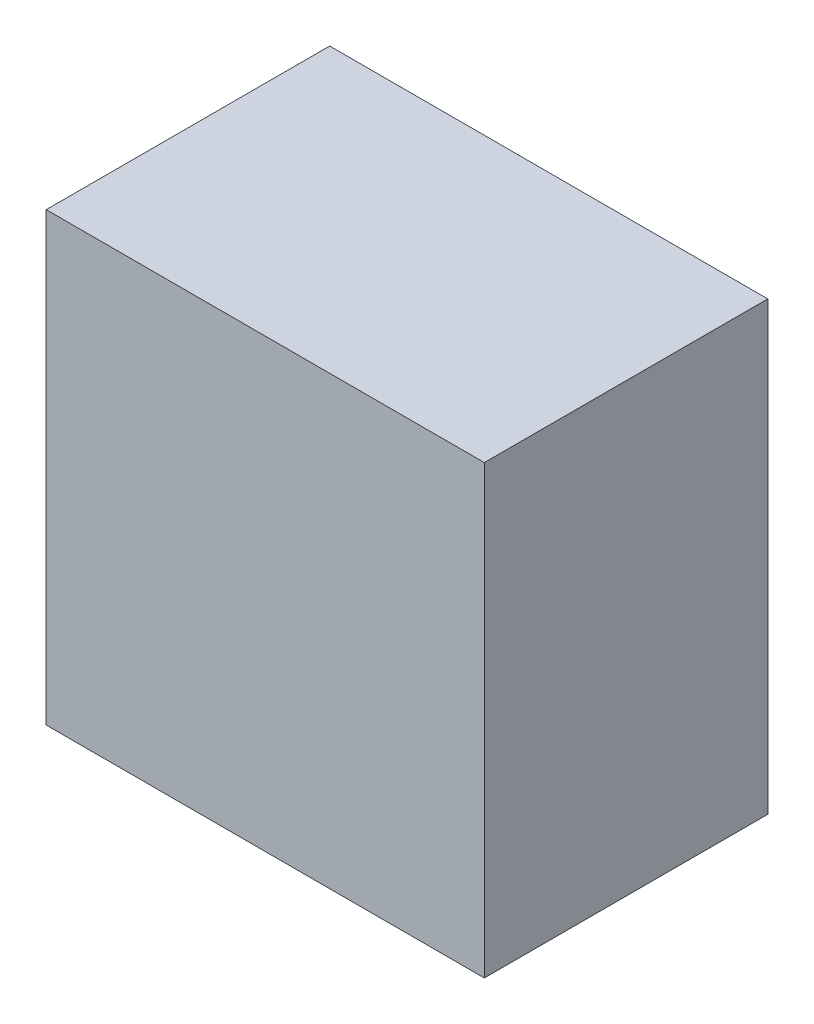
ISO-10303-21;
HEADER;
FILE_DESCRIPTION(('STEP AP214'),'2;1');
FILE_NAME('part.step','',(''),(''),'','','');
FILE_SCHEMA(('AUTOMOTIVE_DESIGN { 1 0 10303 214 1 1 1 1 }'));
ENDSEC;
DATA;
#1=APPLICATION_CONTEXT('core data for automotive mechanical design processes');
#2=APPLICATION_PROTOCOL_DEFINITION('international standard','automotive_design',2000,#1);
#3=PRODUCT_CONTEXT('',#1,'mechanical');
#4=PRODUCT('Part','Part','',(#3));
#5=PRODUCT_RELATED_PRODUCT_CATEGORY('part','',(#4));
#6=PRODUCT_DEFINITION_FORMATION('','',#4);
#7=PRODUCT_DEFINITION_CONTEXT('part definition',#1,'design');
#8=PRODUCT_DEFINITION('design','',#6,#7);
#9=PRODUCT_DEFINITION_SHAPE('','',#8);
#10=(LENGTH_UNIT() NAMED_UNIT(*) SI_UNIT(.MILLI.,.METRE.));
#11=(NAMED_UNIT(*) PLANE_ANGLE_UNIT() SI_UNIT($,.RADIAN.));
#12=(NAMED_UNIT(*) SI_UNIT($,.STERADIAN.) SOLID_ANGLE_UNIT());
#13=UNCERTAINTY_MEASURE_WITH_UNIT(LENGTH_MEASURE(1.E-05),#10,'distance_accuracy_value','');
#14=(GEOMETRIC_REPRESENTATION_CONTEXT(3) GLOBAL_UNCERTAINTY_ASSIGNED_CONTEXT((#13)) GLOBAL_UNIT_ASSIGNED_CONTEXT((#10,
#11,#12)) REPRESENTATION_CONTEXT('',''));
#15=CARTESIAN_POINT('',(0.,0.,0.));
#16=DIRECTION('',(0.,0.,1.));
#17=DIRECTION('',(1.,0.,0.));
#18=AXIS2_PLACEMENT_3D('',#15,#16,#17);
#19=CARTESIAN_POINT('',(0.,0.,50.8));
#20=DIRECTION('',(1.,0.,0.));
#21=DIRECTION('',(0.,0.,-1.));
#22=AXIS2_PLACEMENT_3D('',#19,#20,#21);
#23=PLANE('',#22);
#24=DIRECTION('',(0.,-1.,0.));
#25=VECTOR('',#24,1.);
#26=CARTESIAN_POINT('',(0.,0.,0.));
#27=LINE('',#26,#25);
#28=CARTESIAN_POINT('',(0.,79.9960055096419,0.));
#29=VERTEX_POINT('',#28);
#30=CARTESIAN_POINT('',(0.,0.,0.));
#31=VERTEX_POINT('',#30);
#32=EDGE_CURVE('E93',#29,#31,#27,.T.);
#33=ORIENTED_EDGE('',*,*,#32,.T.);
#34=DIRECTION('',(0.,0.,-1.));
#35=VECTOR('',#34,1.);
#36=CARTESIAN_POINT('',(0.,0.,50.8));
#37=LINE('',#36,#35);
#38=CARTESIAN_POINT('',(0.,0.,50.8));
#39=VERTEX_POINT('',#38);
#40=EDGE_CURVE('E11',#39,#31,#37,.T.);
#41=ORIENTED_EDGE('',*,*,#40,.F.);
#42=DIRECTION('',(0.,-1.,0.));
#43=VECTOR('',#42,1.);
#44=CARTESIAN_POINT('',(0.,0.,50.8));
#45=LINE('',#44,#43);
#46=CARTESIAN_POINT('',(0.,79.9960055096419,50.8));
#47=VERTEX_POINT('',#46);
#48=EDGE_CURVE('E81',#47,#39,#45,.T.);
#49=ORIENTED_EDGE('',*,*,#48,.F.);
#50=DIRECTION('',(0.,0.,-1.));
#51=VECTOR('',#50,1.);
#52=CARTESIAN_POINT('',(0.,79.9960055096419,50.8));
#53=LINE('',#52,#51);
#54=EDGE_CURVE('E89',#47,#29,#53,.T.);
#55=ORIENTED_EDGE('',*,*,#54,.T.);
#56=EDGE_LOOP('',(#33,#41,#49,#55));
#57=FACE_BOUND('',#56,.T.);
#58=ADVANCED_FACE('F30',(#57),#23,.F.);
#59=CARTESIAN_POINT('',(0.,0.,50.8));
#60=DIRECTION('',(0.,1.,0.));
#61=DIRECTION('',(0.,0.,1.));
#62=AXIS2_PLACEMENT_3D('',#59,#60,#61);
#63=PLANE('',#62);
#64=DIRECTION('',(1.,0.,0.));
#65=VECTOR('',#64,1.);
#66=CARTESIAN_POINT('',(0.,0.,0.));
#67=LINE('',#66,#65);
#68=CARTESIAN_POINT('',(78.5090909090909,0.,0.));
#69=VERTEX_POINT('',#68);
#70=EDGE_CURVE('E85',#31,#69,#67,.T.);
#71=ORIENTED_EDGE('',*,*,#70,.T.);
#72=DIRECTION('',(0.,0.,-1.));
#73=VECTOR('',#72,1.);
#74=CARTESIAN_POINT('',(78.5090909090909,0.,50.8));
#75=LINE('',#74,#73);
#76=CARTESIAN_POINT('',(78.5090909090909,0.,50.8));
#77=VERTEX_POINT('',#76);
#78=EDGE_CURVE('E38',#77,#69,#75,.T.);
#79=ORIENTED_EDGE('',*,*,#78,.F.);
#80=DIRECTION('',(1.,0.,0.));
#81=VECTOR('',#80,1.);
#82=CARTESIAN_POINT('',(0.,0.,50.8));
#83=LINE('',#82,#81);
#84=EDGE_CURVE('E76',#39,#77,#83,.T.);
#85=ORIENTED_EDGE('',*,*,#84,.F.);
#86=ORIENTED_EDGE('',*,*,#40,.T.);
#87=EDGE_LOOP('',(#71,#79,#85,#86));
#88=FACE_BOUND('',#87,.T.);
#89=ADVANCED_FACE('F84',(#88),#63,.F.);
#90=CARTESIAN_POINT('',(78.5090909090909,0.,50.8));
#91=DIRECTION('',(-1.,0.,0.));
#92=DIRECTION('',(0.,0.,1.));
#93=AXIS2_PLACEMENT_3D('',#90,#91,#92);
#94=PLANE('',#93);
#95=DIRECTION('',(0.,1.,0.));
#96=VECTOR('',#95,1.);
#97=CARTESIAN_POINT('',(78.5090909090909,0.,0.));
#98=LINE('',#97,#96);
#99=CARTESIAN_POINT('',(78.5090909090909,79.9960055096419,0.));
#100=VERTEX_POINT('',#99);
#101=EDGE_CURVE('E63',#69,#100,#98,.T.);
#102=ORIENTED_EDGE('',*,*,#101,.T.);
#103=DIRECTION('',(0.,0.,-1.));
#104=VECTOR('',#103,1.);
#105=CARTESIAN_POINT('',(78.5090909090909,79.9960055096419,50.8));
#106=LINE('',#105,#104);
#107=CARTESIAN_POINT('',(78.5090909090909,79.9960055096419,50.8));
#108=VERTEX_POINT('',#107);
#109=EDGE_CURVE('E86',#108,#100,#106,.T.);
#110=ORIENTED_EDGE('',*,*,#109,.F.);
#111=DIRECTION('',(0.,1.,0.));
#112=VECTOR('',#111,1.);
#113=CARTESIAN_POINT('',(78.5090909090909,0.,50.8));
#114=LINE('',#113,#112);
#115=EDGE_CURVE('E79',#77,#108,#114,.T.);
#116=ORIENTED_EDGE('',*,*,#115,.F.);
#117=ORIENTED_EDGE('',*,*,#78,.T.);
#118=EDGE_LOOP('',(#102,#110,#116,#117));
#119=FACE_BOUND('',#118,.T.);
#120=ADVANCED_FACE('F87',(#119),#94,.F.);
#121=CARTESIAN_POINT('',(0.,79.9960055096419,50.8));
#122=DIRECTION('',(0.,-1.,0.));
#123=DIRECTION('',(0.,0.,-1.));
#124=AXIS2_PLACEMENT_3D('',#121,#122,#123);
#125=PLANE('',#124);
#126=DIRECTION('',(-1.,0.,0.));
#127=VECTOR('',#126,1.);
#128=CARTESIAN_POINT('',(0.,79.9960055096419,0.));
#129=LINE('',#128,#127);
#130=EDGE_CURVE('E69',#100,#29,#129,.T.);
#131=ORIENTED_EDGE('',*,*,#130,.T.);
#132=ORIENTED_EDGE('',*,*,#54,.F.);
#133=DIRECTION('',(-1.,0.,0.));
#134=VECTOR('',#133,1.);
#135=CARTESIAN_POINT('',(0.,79.9960055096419,50.8));
#136=LINE('',#135,#134);
#137=EDGE_CURVE('E46',#108,#47,#136,.T.);
#138=ORIENTED_EDGE('',*,*,#137,.F.);
#139=ORIENTED_EDGE('',*,*,#109,.T.);
#140=EDGE_LOOP('',(#131,#132,#138,#139));
#141=FACE_BOUND('',#140,.T.);
#142=ADVANCED_FACE('F100',(#141),#125,.F.);
#143=CARTESIAN_POINT('',(0.,79.9960055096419,50.8));
#144=DIRECTION('',(0.,0.,-1.));
#145=DIRECTION('',(-1.,0.,0.));
#146=AXIS2_PLACEMENT_3D('',#143,#144,#145);
#147=PLANE('',#146);
#148=ORIENTED_EDGE('',*,*,#48,.T.);
#149=ORIENTED_EDGE('',*,*,#84,.T.);
#150=ORIENTED_EDGE('',*,*,#115,.T.);
#151=ORIENTED_EDGE('',*,*,#137,.T.);
#152=EDGE_LOOP('',(#148,#149,#150,#151));
#153=FACE_BOUND('',#152,.T.);
#154=ADVANCED_FACE('F77',(#153),#147,.F.);
#155=CARTESIAN_POINT('',(0.,79.9960055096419,0.));
#156=DIRECTION('',(0.,0.,-1.));
#157=DIRECTION('',(-1.,0.,0.));
#158=AXIS2_PLACEMENT_3D('',#155,#156,#157);
#159=PLANE('',#158);
#160=ORIENTED_EDGE('',*,*,#32,.F.);
#161=ORIENTED_EDGE('',*,*,#130,.F.);
#162=ORIENTED_EDGE('',*,*,#101,.F.);
#163=ORIENTED_EDGE('',*,*,#70,.F.);
#164=EDGE_LOOP('',(#160,#161,#162,#163));
#165=FACE_BOUND('',#164,.T.);
#166=ADVANCED_FACE('F103',(#165),#159,.T.);
#167=CLOSED_SHELL('',(#58,#89,#120,#142,#154,#166));
#168=MANIFOLD_SOLID_BREP('B2',#167);
#169=ADVANCED_BREP_SHAPE_REPRESENTATION('',(#18,#168),#14);
#170=SHAPE_DEFINITION_REPRESENTATION(#9,#169);
ENDSEC;
END-ISO-10303-21;
